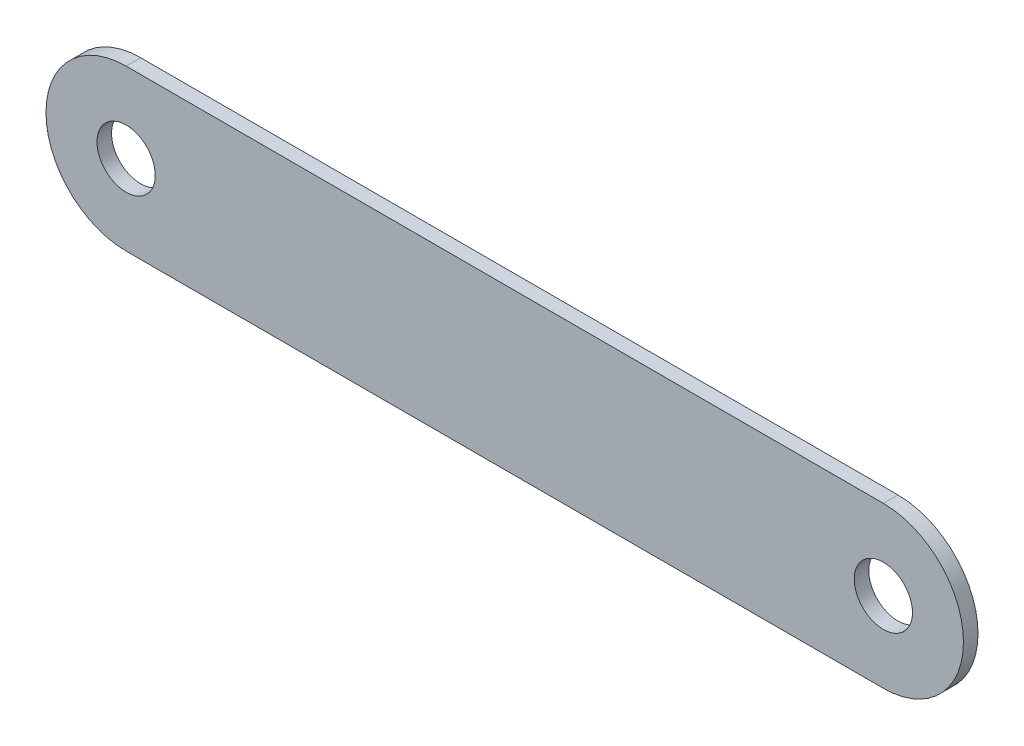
ISO-10303-21;
HEADER;
FILE_DESCRIPTION(('STEP AP214'),'2;1');
FILE_NAME('part.step','',(''),(''),'','','');
FILE_SCHEMA(('AUTOMOTIVE_DESIGN { 1 0 10303 214 1 1 1 1 }'));
ENDSEC;
DATA;
#1=APPLICATION_CONTEXT('core data for automotive mechanical design processes');
#2=APPLICATION_PROTOCOL_DEFINITION('international standard','automotive_design',2000,#1);
#3=PRODUCT_CONTEXT('',#1,'mechanical');
#4=PRODUCT('Part','Part','',(#3));
#5=PRODUCT_RELATED_PRODUCT_CATEGORY('part','',(#4));
#6=PRODUCT_DEFINITION_FORMATION('','',#4);
#7=PRODUCT_DEFINITION_CONTEXT('part definition',#1,'design');
#8=PRODUCT_DEFINITION('design','',#6,#7);
#9=PRODUCT_DEFINITION_SHAPE('','',#8);
#10=(LENGTH_UNIT() NAMED_UNIT(*) SI_UNIT(.MILLI.,.METRE.));
#11=(NAMED_UNIT(*) PLANE_ANGLE_UNIT() SI_UNIT($,.RADIAN.));
#12=(NAMED_UNIT(*) SI_UNIT($,.STERADIAN.) SOLID_ANGLE_UNIT());
#13=UNCERTAINTY_MEASURE_WITH_UNIT(LENGTH_MEASURE(1.E-05),#10,'distance_accuracy_value','');
#14=(GEOMETRIC_REPRESENTATION_CONTEXT(3) GLOBAL_UNCERTAINTY_ASSIGNED_CONTEXT((#13)) GLOBAL_UNIT_ASSIGNED_CONTEXT((#10,
#11,#12)) REPRESENTATION_CONTEXT('',''));
#15=CARTESIAN_POINT('',(0.,0.,0.));
#16=DIRECTION('',(0.,0.,1.));
#17=DIRECTION('',(1.,0.,0.));
#18=AXIS2_PLACEMENT_3D('',#15,#16,#17);
#19=CARTESIAN_POINT('',(0.,0.,1.));
#20=DIRECTION('',(0.,0.,1.));
#21=DIRECTION('',(1.,0.,0.));
#22=AXIS2_PLACEMENT_3D('',#19,#20,#21);
#23=PLANE('',#22);
#24=CARTESIAN_POINT('',(52.,0.,1.));
#25=DIRECTION('',(0.,0.,1.));
#26=DIRECTION('',(1.,0.,0.));
#27=AXIS2_PLACEMENT_3D('',#24,#25,#26);
#28=CIRCLE('',#27,2.);
#29=CARTESIAN_POINT('',(54.,0.,1.));
#30=VERTEX_POINT('',#29);
#31=EDGE_CURVE('E98',#30,#30,#28,.T.);
#32=ORIENTED_EDGE('',*,*,#31,.F.);
#33=EDGE_LOOP('',(#32));
#34=FACE_BOUND('',#33,.T.);
#35=CARTESIAN_POINT('',(0.,0.,1.));
#36=DIRECTION('',(0.,0.,1.));
#37=DIRECTION('',(1.,0.,0.));
#38=AXIS2_PLACEMENT_3D('',#35,#36,#37);
#39=CIRCLE('',#38,5.5);
#40=CARTESIAN_POINT('',(0.,5.5,1.));
#41=VERTEX_POINT('',#40);
#42=CARTESIAN_POINT('',(0.,-5.5,1.));
#43=VERTEX_POINT('',#42);
#44=EDGE_CURVE('E83',#41,#43,#39,.T.);
#45=ORIENTED_EDGE('',*,*,#44,.T.);
#46=DIRECTION('',(1.,0.,0.));
#47=VECTOR('',#46,1.);
#48=CARTESIAN_POINT('',(52.,-5.5,1.));
#49=LINE('',#48,#47);
#50=CARTESIAN_POINT('',(52.,-5.5,1.));
#51=VERTEX_POINT('',#50);
#52=EDGE_CURVE('E78',#43,#51,#49,.T.);
#53=ORIENTED_EDGE('',*,*,#52,.T.);
#54=CARTESIAN_POINT('',(52.,0.,1.));
#55=DIRECTION('',(0.,0.,1.));
#56=DIRECTION('',(1.,0.,0.));
#57=AXIS2_PLACEMENT_3D('',#54,#55,#56);
#58=CIRCLE('',#57,5.5);
#59=CARTESIAN_POINT('',(52.,5.5,1.));
#60=VERTEX_POINT('',#59);
#61=EDGE_CURVE('E81',#51,#60,#58,.T.);
#62=ORIENTED_EDGE('',*,*,#61,.T.);
#63=DIRECTION('',(-1.,0.,0.));
#64=VECTOR('',#63,1.);
#65=CARTESIAN_POINT('',(0.,5.5,1.));
#66=LINE('',#65,#64);
#67=EDGE_CURVE('E48',#60,#41,#66,.T.);
#68=ORIENTED_EDGE('',*,*,#67,.T.);
#69=EDGE_LOOP('',(#45,#53,#62,#68));
#70=FACE_BOUND('',#69,.T.);
#71=CARTESIAN_POINT('',(0.,0.,1.));
#72=DIRECTION('',(0.,0.,1.));
#73=DIRECTION('',(1.,0.,0.));
#74=AXIS2_PLACEMENT_3D('',#71,#72,#73);
#75=CIRCLE('',#74,2.);
#76=CARTESIAN_POINT('',(2.,0.,1.));
#77=VERTEX_POINT('',#76);
#78=EDGE_CURVE('E113',#77,#77,#75,.T.);
#79=ORIENTED_EDGE('',*,*,#78,.F.);
#80=EDGE_LOOP('',(#79));
#81=FACE_BOUND('',#80,.T.);
#82=ADVANCED_FACE('F31',(#34,#70,#81),#23,.T.);
#83=CARTESIAN_POINT('',(0.,0.,0.));
#84=DIRECTION('',(0.,0.,1.));
#85=DIRECTION('',(1.,0.,0.));
#86=AXIS2_PLACEMENT_3D('',#83,#84,#85);
#87=PLANE('',#86);
#88=CARTESIAN_POINT('',(52.,0.,0.));
#89=DIRECTION('',(0.,0.,1.));
#90=DIRECTION('',(1.,0.,0.));
#91=AXIS2_PLACEMENT_3D('',#88,#89,#90);
#92=CIRCLE('',#91,2.);
#93=CARTESIAN_POINT('',(54.,0.,0.));
#94=VERTEX_POINT('',#93);
#95=EDGE_CURVE('E110',#94,#94,#92,.T.);
#96=ORIENTED_EDGE('',*,*,#95,.T.);
#97=EDGE_LOOP('',(#96));
#98=FACE_BOUND('',#97,.T.);
#99=CARTESIAN_POINT('',(0.,0.,0.));
#100=DIRECTION('',(0.,0.,1.));
#101=DIRECTION('',(1.,0.,0.));
#102=AXIS2_PLACEMENT_3D('',#99,#100,#101);
#103=CIRCLE('',#102,5.5);
#104=CARTESIAN_POINT('',(0.,5.5,0.));
#105=VERTEX_POINT('',#104);
#106=CARTESIAN_POINT('',(0.,-5.5,0.));
#107=VERTEX_POINT('',#106);
#108=EDGE_CURVE('E95',#105,#107,#103,.T.);
#109=ORIENTED_EDGE('',*,*,#108,.F.);
#110=DIRECTION('',(-1.,0.,0.));
#111=VECTOR('',#110,1.);
#112=CARTESIAN_POINT('',(0.,5.5,0.));
#113=LINE('',#112,#111);
#114=CARTESIAN_POINT('',(52.,5.5,0.));
#115=VERTEX_POINT('',#114);
#116=EDGE_CURVE('E71',#115,#105,#113,.T.);
#117=ORIENTED_EDGE('',*,*,#116,.F.);
#118=CARTESIAN_POINT('',(52.,0.,0.));
#119=DIRECTION('',(0.,0.,1.));
#120=DIRECTION('',(1.,0.,0.));
#121=AXIS2_PLACEMENT_3D('',#118,#119,#120);
#122=CIRCLE('',#121,5.5);
#123=CARTESIAN_POINT('',(52.,-5.5,0.));
#124=VERTEX_POINT('',#123);
#125=EDGE_CURVE('E65',#124,#115,#122,.T.);
#126=ORIENTED_EDGE('',*,*,#125,.F.);
#127=DIRECTION('',(1.,0.,0.));
#128=VECTOR('',#127,1.);
#129=CARTESIAN_POINT('',(52.,-5.5,0.));
#130=LINE('',#129,#128);
#131=EDGE_CURVE('E87',#107,#124,#130,.T.);
#132=ORIENTED_EDGE('',*,*,#131,.F.);
#133=EDGE_LOOP('',(#109,#117,#126,#132));
#134=FACE_BOUND('',#133,.T.);
#135=CARTESIAN_POINT('',(0.,0.,0.));
#136=DIRECTION('',(0.,0.,1.));
#137=DIRECTION('',(1.,0.,0.));
#138=AXIS2_PLACEMENT_3D('',#135,#136,#137);
#139=CIRCLE('',#138,2.);
#140=CARTESIAN_POINT('',(2.,0.,0.));
#141=VERTEX_POINT('',#140);
#142=EDGE_CURVE('E116',#141,#141,#139,.T.);
#143=ORIENTED_EDGE('',*,*,#142,.T.);
#144=EDGE_LOOP('',(#143));
#145=FACE_BOUND('',#144,.T.);
#146=ADVANCED_FACE('F106',(#98,#134,#145),#87,.F.);
#147=CARTESIAN_POINT('',(0.,0.,1.));
#148=DIRECTION('',(0.,0.,-1.));
#149=DIRECTION('',(-1.,0.,0.));
#150=AXIS2_PLACEMENT_3D('',#147,#148,#149);
#151=CYLINDRICAL_SURFACE('',#150,5.5);
#152=ORIENTED_EDGE('',*,*,#108,.T.);
#153=DIRECTION('',(0.,0.,-1.));
#154=VECTOR('',#153,1.);
#155=CARTESIAN_POINT('',(0.,-5.5,1.));
#156=LINE('',#155,#154);
#157=EDGE_CURVE('E11',#43,#107,#156,.T.);
#158=ORIENTED_EDGE('',*,*,#157,.F.);
#159=ORIENTED_EDGE('',*,*,#44,.F.);
#160=DIRECTION('',(0.,0.,-1.));
#161=VECTOR('',#160,1.);
#162=CARTESIAN_POINT('',(0.,5.5,1.));
#163=LINE('',#162,#161);
#164=EDGE_CURVE('E91',#41,#105,#163,.T.);
#165=ORIENTED_EDGE('',*,*,#164,.T.);
#166=EDGE_LOOP('',(#152,#158,#159,#165));
#167=FACE_BOUND('',#166,.T.);
#168=ADVANCED_FACE('F33',(#167),#151,.T.);
#169=CARTESIAN_POINT('',(52.,-5.5,1.));
#170=DIRECTION('',(0.,1.,0.));
#171=DIRECTION('',(-1.,0.,0.));
#172=AXIS2_PLACEMENT_3D('',#169,#170,#171);
#173=PLANE('',#172);
#174=ORIENTED_EDGE('',*,*,#131,.T.);
#175=DIRECTION('',(0.,0.,-1.));
#176=VECTOR('',#175,1.);
#177=CARTESIAN_POINT('',(52.,-5.5,1.));
#178=LINE('',#177,#176);
#179=EDGE_CURVE('E40',#51,#124,#178,.T.);
#180=ORIENTED_EDGE('',*,*,#179,.F.);
#181=ORIENTED_EDGE('',*,*,#52,.F.);
#182=ORIENTED_EDGE('',*,*,#157,.T.);
#183=EDGE_LOOP('',(#174,#180,#181,#182));
#184=FACE_BOUND('',#183,.T.);
#185=ADVANCED_FACE('F86',(#184),#173,.F.);
#186=CARTESIAN_POINT('',(52.,0.,1.));
#187=DIRECTION('',(0.,0.,-1.));
#188=DIRECTION('',(-1.,0.,0.));
#189=AXIS2_PLACEMENT_3D('',#186,#187,#188);
#190=CYLINDRICAL_SURFACE('',#189,5.5);
#191=ORIENTED_EDGE('',*,*,#125,.T.);
#192=DIRECTION('',(0.,0.,-1.));
#193=VECTOR('',#192,1.);
#194=CARTESIAN_POINT('',(52.,5.5,1.));
#195=LINE('',#194,#193);
#196=EDGE_CURVE('E88',#60,#115,#195,.T.);
#197=ORIENTED_EDGE('',*,*,#196,.F.);
#198=ORIENTED_EDGE('',*,*,#61,.F.);
#199=ORIENTED_EDGE('',*,*,#179,.T.);
#200=EDGE_LOOP('',(#191,#197,#198,#199));
#201=FACE_BOUND('',#200,.T.);
#202=ADVANCED_FACE('F89',(#201),#190,.T.);
#203=CARTESIAN_POINT('',(0.,5.5,1.));
#204=DIRECTION('',(0.,-1.,0.));
#205=DIRECTION('',(1.,0.,0.));
#206=AXIS2_PLACEMENT_3D('',#203,#204,#205);
#207=PLANE('',#206);
#208=ORIENTED_EDGE('',*,*,#116,.T.);
#209=ORIENTED_EDGE('',*,*,#164,.F.);
#210=ORIENTED_EDGE('',*,*,#67,.F.);
#211=ORIENTED_EDGE('',*,*,#196,.T.);
#212=EDGE_LOOP('',(#208,#209,#210,#211));
#213=FACE_BOUND('',#212,.T.);
#214=ADVANCED_FACE('F103',(#213),#207,.F.);
#215=CARTESIAN_POINT('',(52.,0.,1.));
#216=DIRECTION('',(0.,0.,-1.));
#217=DIRECTION('',(-1.,0.,0.));
#218=AXIS2_PLACEMENT_3D('',#215,#216,#217);
#219=CYLINDRICAL_SURFACE('',#218,2.);
#220=ORIENTED_EDGE('',*,*,#31,.T.);
#221=EDGE_LOOP('',(#220));
#222=FACE_BOUND('',#221,.T.);
#223=ORIENTED_EDGE('',*,*,#95,.F.);
#224=EDGE_LOOP('',(#223));
#225=FACE_BOUND('',#224,.T.);
#226=ADVANCED_FACE('F134',(#222,#225),#219,.F.);
#227=CARTESIAN_POINT('',(0.,0.,1.));
#228=DIRECTION('',(0.,0.,-1.));
#229=DIRECTION('',(-1.,0.,0.));
#230=AXIS2_PLACEMENT_3D('',#227,#228,#229);
#231=CYLINDRICAL_SURFACE('',#230,2.);
#232=ORIENTED_EDGE('',*,*,#78,.T.);
#233=EDGE_LOOP('',(#232));
#234=FACE_BOUND('',#233,.T.);
#235=ORIENTED_EDGE('',*,*,#142,.F.);
#236=EDGE_LOOP('',(#235));
#237=FACE_BOUND('',#236,.T.);
#238=ADVANCED_FACE('F122',(#234,#237),#231,.F.);
#239=CLOSED_SHELL('',(#82,#146,#168,#185,#202,#214,#226,#238));
#240=MANIFOLD_SOLID_BREP('B2',#239);
#241=ADVANCED_BREP_SHAPE_REPRESENTATION('',(#18,#240),#14);
#242=SHAPE_DEFINITION_REPRESENTATION(#9,#241);
ENDSEC;
END-ISO-10303-21;
